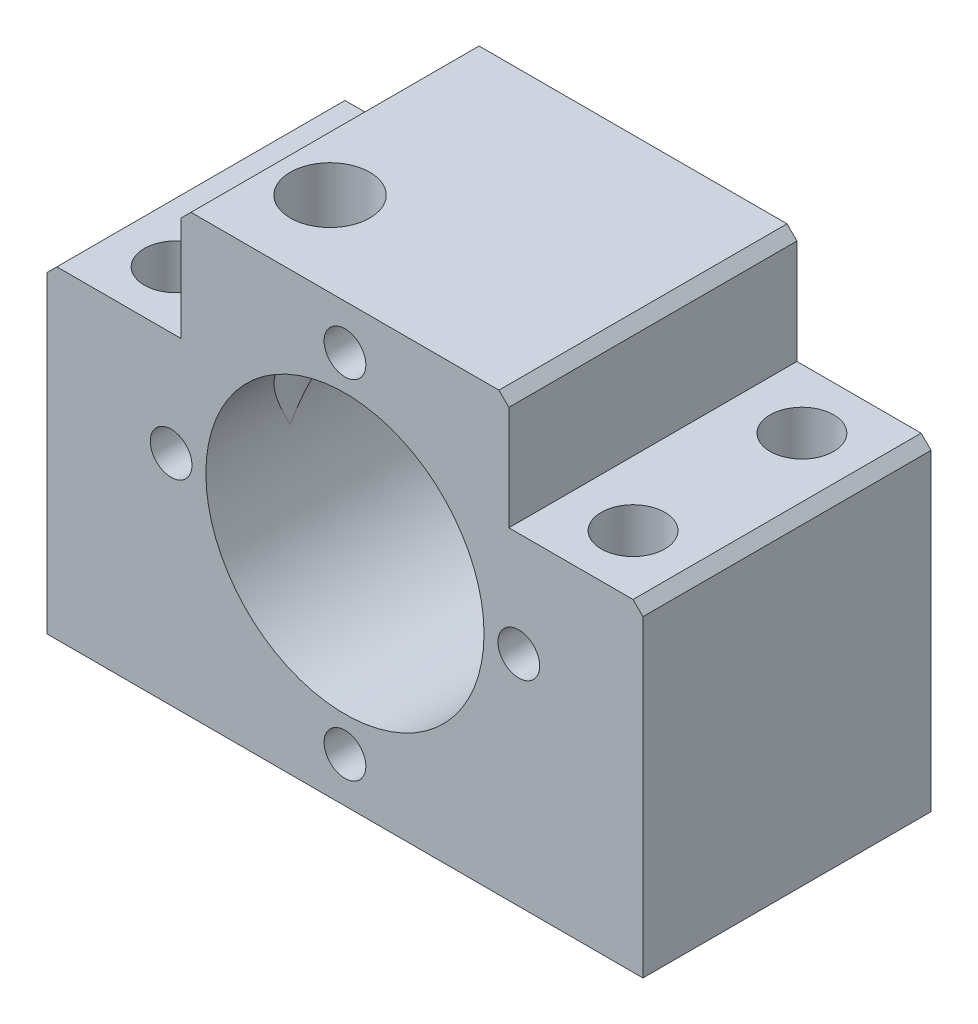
ISO-10303-21;
HEADER;
FILE_DESCRIPTION(('STEP AP214'),'2;1');
FILE_NAME('part.step','',(''),(''),'','','');
FILE_SCHEMA(('AUTOMOTIVE_DESIGN { 1 0 10303 214 1 1 1 1 }'));
ENDSEC;
DATA;
#1=APPLICATION_CONTEXT('core data for automotive mechanical design processes');
#2=APPLICATION_PROTOCOL_DEFINITION('international standard','automotive_design',2000,#1);
#3=PRODUCT_CONTEXT('',#1,'mechanical');
#4=PRODUCT('Part','Part','',(#3));
#5=PRODUCT_RELATED_PRODUCT_CATEGORY('part','',(#4));
#6=PRODUCT_DEFINITION_FORMATION('','',#4);
#7=PRODUCT_DEFINITION_CONTEXT('part definition',#1,'design');
#8=PRODUCT_DEFINITION('design','',#6,#7);
#9=PRODUCT_DEFINITION_SHAPE('','',#8);
#10=(LENGTH_UNIT() NAMED_UNIT(*) SI_UNIT(.MILLI.,.METRE.));
#11=(NAMED_UNIT(*) PLANE_ANGLE_UNIT() SI_UNIT($,.RADIAN.));
#12=(NAMED_UNIT(*) SI_UNIT($,.STERADIAN.) SOLID_ANGLE_UNIT());
#13=UNCERTAINTY_MEASURE_WITH_UNIT(LENGTH_MEASURE(1.E-05),#10,'distance_accuracy_value','');
#14=(GEOMETRIC_REPRESENTATION_CONTEXT(3) GLOBAL_UNCERTAINTY_ASSIGNED_CONTEXT((#13)) GLOBAL_UNIT_ASSIGNED_CONTEXT((#10,
#11,#12)) REPRESENTATION_CONTEXT('',''));
#15=CARTESIAN_POINT('',(0.,0.,0.));
#16=DIRECTION('',(0.,0.,1.));
#17=DIRECTION('',(1.,0.,0.));
#18=AXIS2_PLACEMENT_3D('',#15,#16,#17);
#19=CARTESIAN_POINT('',(0.,0.,29.));
#20=DIRECTION('',(0.,0.,1.));
#21=DIRECTION('',(1.,0.,0.));
#22=AXIS2_PLACEMENT_3D('',#19,#20,#21);
#23=PLANE('',#22);
#24=DIRECTION('',(0.,1.,0.));
#25=VECTOR('',#24,1.);
#26=CARTESIAN_POINT('',(30.,10.5,29.));
#27=LINE('',#26,#25);
#28=CARTESIAN_POINT('',(30.,-22.,29.));
#29=VERTEX_POINT('',#28);
#30=CARTESIAN_POINT('',(30.,9.50000000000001,29.));
#31=VERTEX_POINT('',#30);
#32=EDGE_CURVE('E150',#29,#31,#27,.T.);
#33=ORIENTED_EDGE('',*,*,#32,.T.);
#34=DIRECTION('',(0.707106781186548,-0.707106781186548,0.));
#35=VECTOR('',#34,1.);
#36=CARTESIAN_POINT('',(19.75,19.75,29.));
#37=LINE('',#36,#35);
#38=CARTESIAN_POINT('',(29.,10.5,29.));
#39=VERTEX_POINT('',#38);
#40=EDGE_CURVE('E146',#31,#39,#37,.F.);
#41=ORIENTED_EDGE('',*,*,#40,.T.);
#42=DIRECTION('',(-1.,0.,0.));
#43=VECTOR('',#42,1.);
#44=CARTESIAN_POINT('',(30.,10.5,29.));
#45=LINE('',#44,#43);
#46=CARTESIAN_POINT('',(16.5,10.5,29.));
#47=VERTEX_POINT('',#46);
#48=EDGE_CURVE('E138',#39,#47,#45,.T.);
#49=ORIENTED_EDGE('',*,*,#48,.T.);
#50=DIRECTION('',(0.,1.,0.));
#51=VECTOR('',#50,1.);
#52=CARTESIAN_POINT('',(16.5,10.5,29.));
#53=LINE('',#52,#51);
#54=CARTESIAN_POINT('',(16.5,21.,29.));
#55=VERTEX_POINT('',#54);
#56=EDGE_CURVE('E143',#47,#55,#53,.T.);
#57=ORIENTED_EDGE('',*,*,#56,.T.);
#58=DIRECTION('',(0.70710678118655,-0.707106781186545,0.));
#59=VECTOR('',#58,1.);
#60=CARTESIAN_POINT('',(18.7499999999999,18.7500000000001,29.));
#61=LINE('',#60,#59);
#62=CARTESIAN_POINT('',(15.5,22.,29.));
#63=VERTEX_POINT('',#62);
#64=EDGE_CURVE('E226',#55,#63,#61,.F.);
#65=ORIENTED_EDGE('',*,*,#64,.T.);
#66=DIRECTION('',(-1.,0.,0.));
#67=VECTOR('',#66,1.);
#68=CARTESIAN_POINT('',(-16.5,22.,29.));
#69=LINE('',#68,#67);
#70=CARTESIAN_POINT('',(-15.5,22.,29.));
#71=VERTEX_POINT('',#70);
#72=EDGE_CURVE('E166',#63,#71,#69,.T.);
#73=ORIENTED_EDGE('',*,*,#72,.T.);
#74=DIRECTION('',(0.707106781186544,0.707106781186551,0.));
#75=VECTOR('',#74,1.);
#76=CARTESIAN_POINT('',(-18.7500000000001,18.7499999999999,29.));
#77=LINE('',#76,#75);
#78=CARTESIAN_POINT('',(-16.5,21.,29.));
#79=VERTEX_POINT('',#78);
#80=EDGE_CURVE('E224',#71,#79,#77,.F.);
#81=ORIENTED_EDGE('',*,*,#80,.T.);
#82=DIRECTION('',(0.,-1.,0.));
#83=VECTOR('',#82,1.);
#84=CARTESIAN_POINT('',(-16.5,10.5,29.));
#85=LINE('',#84,#83);
#86=CARTESIAN_POINT('',(-16.5,10.5,29.));
#87=VERTEX_POINT('',#86);
#88=EDGE_CURVE('E169',#79,#87,#85,.T.);
#89=ORIENTED_EDGE('',*,*,#88,.T.);
#90=DIRECTION('',(-1.,0.,0.));
#91=VECTOR('',#90,1.);
#92=CARTESIAN_POINT('',(-30.,10.5,29.));
#93=LINE('',#92,#91);
#94=CARTESIAN_POINT('',(-29.,10.5,29.));
#95=VERTEX_POINT('',#94);
#96=EDGE_CURVE('E174',#87,#95,#93,.T.);
#97=ORIENTED_EDGE('',*,*,#96,.T.);
#98=DIRECTION('',(0.70710678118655,0.707106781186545,0.));
#99=VECTOR('',#98,1.);
#100=CARTESIAN_POINT('',(-19.7499999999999,19.75,29.));
#101=LINE('',#100,#99);
#102=CARTESIAN_POINT('',(-30.,9.49999999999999,29.));
#103=VERTEX_POINT('',#102);
#104=EDGE_CURVE('E67',#95,#103,#101,.F.);
#105=ORIENTED_EDGE('',*,*,#104,.T.);
#106=DIRECTION('',(0.,-1.,0.));
#107=VECTOR('',#106,1.);
#108=CARTESIAN_POINT('',(-30.,10.5,29.));
#109=LINE('',#108,#107);
#110=CARTESIAN_POINT('',(-30.,-22.,29.));
#111=VERTEX_POINT('',#110);
#112=EDGE_CURVE('E176',#103,#111,#109,.T.);
#113=ORIENTED_EDGE('',*,*,#112,.T.);
#114=DIRECTION('',(1.,0.,0.));
#115=VECTOR('',#114,1.);
#116=CARTESIAN_POINT('',(-30.,-22.,29.));
#117=LINE('',#116,#115);
#118=EDGE_CURVE('E178',#111,#29,#117,.T.);
#119=ORIENTED_EDGE('',*,*,#118,.T.);
#120=EDGE_LOOP('',(#33,#41,#49,#57,#65,#73,#81,#89,#97,#105,#113,#119));
#121=FACE_BOUND('',#120,.T.);
#122=CARTESIAN_POINT('',(0.,0.,29.));
#123=DIRECTION('',(0.,0.,-1.));
#124=DIRECTION('',(-1.,0.,0.));
#125=AXIS2_PLACEMENT_3D('',#122,#123,#124);
#126=CIRCLE('',#125,14.);
#127=CARTESIAN_POINT('',(-14.,0.,29.));
#128=VERTEX_POINT('',#127);
#129=EDGE_CURVE('E211',#128,#128,#126,.T.);
#130=ORIENTED_EDGE('',*,*,#129,.T.);
#131=EDGE_LOOP('',(#130));
#132=FACE_BOUND('',#131,.T.);
#133=CARTESIAN_POINT('',(0.,17.5,29.));
#134=DIRECTION('',(0.,0.,-1.));
#135=DIRECTION('',(-1.,0.,0.));
#136=AXIS2_PLACEMENT_3D('',#133,#134,#135);
#137=CIRCLE('',#136,2.09999999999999);
#138=CARTESIAN_POINT('',(-2.09999999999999,17.5,29.));
#139=VERTEX_POINT('',#138);
#140=EDGE_CURVE('E380',#139,#139,#137,.T.);
#141=ORIENTED_EDGE('',*,*,#140,.T.);
#142=EDGE_LOOP('',(#141));
#143=FACE_BOUND('',#142,.T.);
#144=CARTESIAN_POINT('',(0.,-17.5,29.));
#145=DIRECTION('',(0.,0.,-1.));
#146=DIRECTION('',(-1.,0.,0.));
#147=AXIS2_PLACEMENT_3D('',#144,#145,#146);
#148=CIRCLE('',#147,2.09999999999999);
#149=CARTESIAN_POINT('',(-2.09999999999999,-17.5,29.));
#150=VERTEX_POINT('',#149);
#151=EDGE_CURVE('E388',#150,#150,#148,.T.);
#152=ORIENTED_EDGE('',*,*,#151,.T.);
#153=EDGE_LOOP('',(#152));
#154=FACE_BOUND('',#153,.T.);
#155=CARTESIAN_POINT('',(17.5,0.,29.));
#156=DIRECTION('',(0.,0.,-1.));
#157=DIRECTION('',(-1.,0.,0.));
#158=AXIS2_PLACEMENT_3D('',#155,#156,#157);
#159=CIRCLE('',#158,2.09999999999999);
#160=CARTESIAN_POINT('',(15.4,0.,29.));
#161=VERTEX_POINT('',#160);
#162=EDGE_CURVE('E394',#161,#161,#159,.T.);
#163=ORIENTED_EDGE('',*,*,#162,.T.);
#164=EDGE_LOOP('',(#163));
#165=FACE_BOUND('',#164,.T.);
#166=CARTESIAN_POINT('',(-17.5,0.,29.));
#167=DIRECTION('',(0.,0.,-1.));
#168=DIRECTION('',(-1.,0.,0.));
#169=AXIS2_PLACEMENT_3D('',#166,#167,#168);
#170=CIRCLE('',#169,2.09999999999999);
#171=CARTESIAN_POINT('',(-19.6,0.,29.));
#172=VERTEX_POINT('',#171);
#173=EDGE_CURVE('E400',#172,#172,#170,.T.);
#174=ORIENTED_EDGE('',*,*,#173,.T.);
#175=EDGE_LOOP('',(#174));
#176=FACE_BOUND('',#175,.T.);
#177=ADVANCED_FACE('F47',(#121,#132,#143,#154,#165,#176),#23,.T.);
#178=CARTESIAN_POINT('',(0.,0.,0.));
#179=DIRECTION('',(0.,0.,1.));
#180=DIRECTION('',(1.,0.,0.));
#181=AXIS2_PLACEMENT_3D('',#178,#179,#180);
#182=PLANE('',#181);
#183=CARTESIAN_POINT('',(0.,0.,0.));
#184=DIRECTION('',(0.,0.,1.));
#185=DIRECTION('',(1.,0.,0.));
#186=AXIS2_PLACEMENT_3D('',#183,#184,#185);
#187=CIRCLE('',#186,13.5);
#188=CARTESIAN_POINT('',(13.5,0.,0.));
#189=VERTEX_POINT('',#188);
#190=EDGE_CURVE('E55',#189,#189,#187,.T.);
#191=ORIENTED_EDGE('',*,*,#190,.T.);
#192=EDGE_LOOP('',(#191));
#193=FACE_BOUND('',#192,.T.);
#194=CARTESIAN_POINT('',(-17.5,0.,0.));
#195=DIRECTION('',(0.,0.,-1.));
#196=DIRECTION('',(-1.,0.,0.));
#197=AXIS2_PLACEMENT_3D('',#194,#195,#196);
#198=CIRCLE('',#197,2.1);
#199=CARTESIAN_POINT('',(-19.6,0.,0.));
#200=VERTEX_POINT('',#199);
#201=EDGE_CURVE('E248',#200,#200,#198,.T.);
#202=ORIENTED_EDGE('',*,*,#201,.F.);
#203=EDGE_LOOP('',(#202));
#204=FACE_BOUND('',#203,.T.);
#205=CARTESIAN_POINT('',(0.,-17.5,0.));
#206=DIRECTION('',(0.,0.,-1.));
#207=DIRECTION('',(-1.,0.,0.));
#208=AXIS2_PLACEMENT_3D('',#205,#206,#207);
#209=CIRCLE('',#208,2.1);
#210=CARTESIAN_POINT('',(-2.1,-17.5,0.));
#211=VERTEX_POINT('',#210);
#212=EDGE_CURVE('E391',#211,#211,#209,.T.);
#213=ORIENTED_EDGE('',*,*,#212,.F.);
#214=EDGE_LOOP('',(#213));
#215=FACE_BOUND('',#214,.T.);
#216=CARTESIAN_POINT('',(0.,17.5,0.));
#217=DIRECTION('',(0.,0.,-1.));
#218=DIRECTION('',(-1.,0.,0.));
#219=AXIS2_PLACEMENT_3D('',#216,#217,#218);
#220=CIRCLE('',#219,2.1);
#221=CARTESIAN_POINT('',(-2.1,17.5,0.));
#222=VERTEX_POINT('',#221);
#223=EDGE_CURVE('E385',#222,#222,#220,.T.);
#224=ORIENTED_EDGE('',*,*,#223,.F.);
#225=EDGE_LOOP('',(#224));
#226=FACE_BOUND('',#225,.T.);
#227=DIRECTION('',(-1.,0.,0.));
#228=VECTOR('',#227,1.);
#229=CARTESIAN_POINT('',(30.,10.5,0.));
#230=LINE('',#229,#228);
#231=CARTESIAN_POINT('',(29.,10.5,0.));
#232=VERTEX_POINT('',#231);
#233=CARTESIAN_POINT('',(16.5,10.5,0.));
#234=VERTEX_POINT('',#233);
#235=EDGE_CURVE('E156',#232,#234,#230,.T.);
#236=ORIENTED_EDGE('',*,*,#235,.F.);
#237=DIRECTION('',(-0.707106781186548,0.707106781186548,0.));
#238=VECTOR('',#237,1.);
#239=CARTESIAN_POINT('',(29.,10.5,0.));
#240=LINE('',#239,#238);
#241=CARTESIAN_POINT('',(30.,9.50000000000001,0.));
#242=VERTEX_POINT('',#241);
#243=EDGE_CURVE('E219',#232,#242,#240,.F.);
#244=ORIENTED_EDGE('',*,*,#243,.T.);
#245=DIRECTION('',(0.,1.,0.));
#246=VECTOR('',#245,1.);
#247=CARTESIAN_POINT('',(30.,10.5,0.));
#248=LINE('',#247,#246);
#249=CARTESIAN_POINT('',(30.,-22.,0.));
#250=VERTEX_POINT('',#249);
#251=EDGE_CURVE('E181',#250,#242,#248,.T.);
#252=ORIENTED_EDGE('',*,*,#251,.F.);
#253=DIRECTION('',(1.,0.,0.));
#254=VECTOR('',#253,1.);
#255=CARTESIAN_POINT('',(-30.,-22.,0.));
#256=LINE('',#255,#254);
#257=CARTESIAN_POINT('',(-30.,-22.,0.));
#258=VERTEX_POINT('',#257);
#259=EDGE_CURVE('E198',#258,#250,#256,.T.);
#260=ORIENTED_EDGE('',*,*,#259,.F.);
#261=DIRECTION('',(0.,-1.,0.));
#262=VECTOR('',#261,1.);
#263=CARTESIAN_POINT('',(-30.,10.5,0.));
#264=LINE('',#263,#262);
#265=CARTESIAN_POINT('',(-30.,9.49999999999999,0.));
#266=VERTEX_POINT('',#265);
#267=EDGE_CURVE('E196',#266,#258,#264,.T.);
#268=ORIENTED_EDGE('',*,*,#267,.F.);
#269=DIRECTION('',(-0.70710678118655,-0.707106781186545,0.));
#270=VECTOR('',#269,1.);
#271=CARTESIAN_POINT('',(-30.,9.49999999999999,0.));
#272=LINE('',#271,#270);
#273=CARTESIAN_POINT('',(-29.,10.5,0.));
#274=VERTEX_POINT('',#273);
#275=EDGE_CURVE('E213',#266,#274,#272,.F.);
#276=ORIENTED_EDGE('',*,*,#275,.T.);
#277=DIRECTION('',(-1.,0.,0.));
#278=VECTOR('',#277,1.);
#279=CARTESIAN_POINT('',(-30.,10.5,0.));
#280=LINE('',#279,#278);
#281=CARTESIAN_POINT('',(-16.5,10.5,0.));
#282=VERTEX_POINT('',#281);
#283=EDGE_CURVE('E193',#282,#274,#280,.T.);
#284=ORIENTED_EDGE('',*,*,#283,.F.);
#285=DIRECTION('',(0.,-1.,0.));
#286=VECTOR('',#285,1.);
#287=CARTESIAN_POINT('',(-16.5,10.5,0.));
#288=LINE('',#287,#286);
#289=CARTESIAN_POINT('',(-16.5,21.,0.));
#290=VERTEX_POINT('',#289);
#291=EDGE_CURVE('E191',#290,#282,#288,.T.);
#292=ORIENTED_EDGE('',*,*,#291,.F.);
#293=DIRECTION('',(-0.707106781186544,-0.707106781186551,0.));
#294=VECTOR('',#293,1.);
#295=CARTESIAN_POINT('',(-16.5,21.,0.));
#296=LINE('',#295,#294);
#297=CARTESIAN_POINT('',(-15.5,22.,0.));
#298=VERTEX_POINT('',#297);
#299=EDGE_CURVE('E215',#290,#298,#296,.F.);
#300=ORIENTED_EDGE('',*,*,#299,.T.);
#301=DIRECTION('',(-1.,0.,0.));
#302=VECTOR('',#301,1.);
#303=CARTESIAN_POINT('',(-16.5,22.,0.));
#304=LINE('',#303,#302);
#305=CARTESIAN_POINT('',(15.5,22.,0.));
#306=VERTEX_POINT('',#305);
#307=EDGE_CURVE('E188',#306,#298,#304,.T.);
#308=ORIENTED_EDGE('',*,*,#307,.F.);
#309=DIRECTION('',(-0.70710678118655,0.707106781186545,0.));
#310=VECTOR('',#309,1.);
#311=CARTESIAN_POINT('',(15.5,22.,0.));
#312=LINE('',#311,#310);
#313=CARTESIAN_POINT('',(16.5,21.,0.));
#314=VERTEX_POINT('',#313);
#315=EDGE_CURVE('E217',#306,#314,#312,.F.);
#316=ORIENTED_EDGE('',*,*,#315,.T.);
#317=DIRECTION('',(0.,1.,0.));
#318=VECTOR('',#317,1.);
#319=CARTESIAN_POINT('',(16.5,10.5,0.));
#320=LINE('',#319,#318);
#321=EDGE_CURVE('E186',#234,#314,#320,.T.);
#322=ORIENTED_EDGE('',*,*,#321,.F.);
#323=EDGE_LOOP('',(#236,#244,#252,#260,#268,#276,#284,#292,#300,#308,#316,#322));
#324=FACE_BOUND('',#323,.T.);
#325=CARTESIAN_POINT('',(17.5,0.,0.));
#326=DIRECTION('',(0.,0.,-1.));
#327=DIRECTION('',(-1.,0.,0.));
#328=AXIS2_PLACEMENT_3D('',#325,#326,#327);
#329=CIRCLE('',#328,2.09999999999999);
#330=CARTESIAN_POINT('',(15.4,0.,0.));
#331=VERTEX_POINT('',#330);
#332=EDGE_CURVE('E397',#331,#331,#329,.T.);
#333=ORIENTED_EDGE('',*,*,#332,.F.);
#334=EDGE_LOOP('',(#333));
#335=FACE_BOUND('',#334,.T.);
#336=ADVANCED_FACE('F290',(#193,#204,#215,#226,#324,#335),#182,.F.);
#337=CARTESIAN_POINT('',(30.,10.5,29.));
#338=DIRECTION('',(-1.,0.,0.));
#339=DIRECTION('',(0.,-1.,0.));
#340=AXIS2_PLACEMENT_3D('',#337,#338,#339);
#341=PLANE('',#340);
#342=ORIENTED_EDGE('',*,*,#251,.T.);
#343=DIRECTION('',(0.,0.,1.));
#344=VECTOR('',#343,1.);
#345=CARTESIAN_POINT('',(30.,9.50000000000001,29.));
#346=LINE('',#345,#344);
#347=EDGE_CURVE('E221',#242,#31,#346,.T.);
#348=ORIENTED_EDGE('',*,*,#347,.T.);
#349=ORIENTED_EDGE('',*,*,#32,.F.);
#350=DIRECTION('',(0.,0.,-1.));
#351=VECTOR('',#350,1.);
#352=CARTESIAN_POINT('',(30.,-22.,29.));
#353=LINE('',#352,#351);
#354=EDGE_CURVE('E180',#29,#250,#353,.T.);
#355=ORIENTED_EDGE('',*,*,#354,.T.);
#356=EDGE_LOOP('',(#342,#348,#349,#355));
#357=FACE_BOUND('',#356,.T.);
#358=ADVANCED_FACE('F295',(#357),#341,.F.);
#359=CARTESIAN_POINT('',(30.,10.5,29.));
#360=DIRECTION('',(0.,-1.,0.));
#361=DIRECTION('',(1.,0.,0.));
#362=AXIS2_PLACEMENT_3D('',#359,#360,#361);
#363=PLANE('',#362);
#364=CARTESIAN_POINT('',(23.,10.5,23.));
#365=DIRECTION('',(0.,-1.,0.));
#366=DIRECTION('',(1.,0.,0.));
#367=AXIS2_PLACEMENT_3D('',#364,#365,#366);
#368=CIRCLE('',#367,3.2);
#369=CARTESIAN_POINT('',(26.2,10.5,23.));
#370=VERTEX_POINT('',#369);
#371=EDGE_CURVE('E360',#370,#370,#368,.T.);
#372=ORIENTED_EDGE('',*,*,#371,.T.);
#373=EDGE_LOOP('',(#372));
#374=FACE_BOUND('',#373,.T.);
#375=CARTESIAN_POINT('',(23.,10.5,5.99999999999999));
#376=DIRECTION('',(0.,-1.,0.));
#377=DIRECTION('',(1.,0.,0.));
#378=AXIS2_PLACEMENT_3D('',#375,#376,#377);
#379=CIRCLE('',#378,3.2);
#380=CARTESIAN_POINT('',(26.2,10.5,5.99999999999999));
#381=VERTEX_POINT('',#380);
#382=EDGE_CURVE('E184',#381,#381,#379,.T.);
#383=ORIENTED_EDGE('',*,*,#382,.T.);
#384=EDGE_LOOP('',(#383));
#385=FACE_BOUND('',#384,.T.);
#386=ORIENTED_EDGE('',*,*,#48,.F.);
#387=DIRECTION('',(0.,0.,-1.));
#388=VECTOR('',#387,1.);
#389=CARTESIAN_POINT('',(29.,10.5,29.));
#390=LINE('',#389,#388);
#391=EDGE_CURVE('E160',#39,#232,#390,.T.);
#392=ORIENTED_EDGE('',*,*,#391,.T.);
#393=ORIENTED_EDGE('',*,*,#235,.T.);
#394=DIRECTION('',(0.,0.,-1.));
#395=VECTOR('',#394,1.);
#396=CARTESIAN_POINT('',(16.5,10.5,29.));
#397=LINE('',#396,#395);
#398=EDGE_CURVE('E153',#47,#234,#397,.T.);
#399=ORIENTED_EDGE('',*,*,#398,.F.);
#400=EDGE_LOOP('',(#386,#392,#393,#399));
#401=FACE_BOUND('',#400,.T.);
#402=ADVANCED_FACE('F154',(#374,#385,#401),#363,.F.);
#403=CARTESIAN_POINT('',(16.5,10.5,29.));
#404=DIRECTION('',(-1.,0.,0.));
#405=DIRECTION('',(0.,-1.,0.));
#406=AXIS2_PLACEMENT_3D('',#403,#404,#405);
#407=PLANE('',#406);
#408=ORIENTED_EDGE('',*,*,#321,.T.);
#409=DIRECTION('',(0.,0.,1.));
#410=VECTOR('',#409,1.);
#411=CARTESIAN_POINT('',(16.5,21.,29.));
#412=LINE('',#411,#410);
#413=EDGE_CURVE('E165',#314,#55,#412,.T.);
#414=ORIENTED_EDGE('',*,*,#413,.T.);
#415=ORIENTED_EDGE('',*,*,#56,.F.);
#416=ORIENTED_EDGE('',*,*,#398,.T.);
#417=EDGE_LOOP('',(#408,#414,#415,#416));
#418=FACE_BOUND('',#417,.T.);
#419=ADVANCED_FACE('F163',(#418),#407,.F.);
#420=CARTESIAN_POINT('',(-16.5,22.,29.));
#421=DIRECTION('',(0.,-1.,0.));
#422=DIRECTION('',(1.,0.,0.));
#423=AXIS2_PLACEMENT_3D('',#420,#421,#422);
#424=PLANE('',#423);
#425=CARTESIAN_POINT('',(-10.,22.,20.5));
#426=DIRECTION('',(0.,1.,0.));
#427=DIRECTION('',(0.,0.,1.));
#428=AXIS2_PLACEMENT_3D('',#425,#426,#427);
#429=CIRCLE('',#428,3.99999999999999);
#430=CARTESIAN_POINT('',(-10.,22.,24.5));
#431=VERTEX_POINT('',#430);
#432=EDGE_CURVE('E249',#431,#431,#429,.T.);
#433=ORIENTED_EDGE('',*,*,#432,.F.);
#434=EDGE_LOOP('',(#433));
#435=FACE_BOUND('',#434,.T.);
#436=ORIENTED_EDGE('',*,*,#72,.F.);
#437=DIRECTION('',(0.,0.,-1.));
#438=VECTOR('',#437,1.);
#439=CARTESIAN_POINT('',(15.5,22.,29.));
#440=LINE('',#439,#438);
#441=EDGE_CURVE('E231',#63,#306,#440,.T.);
#442=ORIENTED_EDGE('',*,*,#441,.T.);
#443=ORIENTED_EDGE('',*,*,#307,.T.);
#444=DIRECTION('',(0.,0.,1.));
#445=VECTOR('',#444,1.);
#446=CARTESIAN_POINT('',(-15.5,22.,29.));
#447=LINE('',#446,#445);
#448=EDGE_CURVE('E229',#298,#71,#447,.T.);
#449=ORIENTED_EDGE('',*,*,#448,.T.);
#450=EDGE_LOOP('',(#436,#442,#443,#449));
#451=FACE_BOUND('',#450,.T.);
#452=ADVANCED_FACE('F317',(#435,#451),#424,.F.);
#453=CARTESIAN_POINT('',(-16.5,10.5,29.));
#454=DIRECTION('',(1.,0.,0.));
#455=DIRECTION('',(0.,1.,0.));
#456=AXIS2_PLACEMENT_3D('',#453,#454,#455);
#457=PLANE('',#456);
#458=ORIENTED_EDGE('',*,*,#88,.F.);
#459=DIRECTION('',(0.,0.,-1.));
#460=VECTOR('',#459,1.);
#461=CARTESIAN_POINT('',(-16.5,21.,29.));
#462=LINE('',#461,#460);
#463=EDGE_CURVE('E235',#79,#290,#462,.T.);
#464=ORIENTED_EDGE('',*,*,#463,.T.);
#465=ORIENTED_EDGE('',*,*,#291,.T.);
#466=DIRECTION('',(0.,0.,-1.));
#467=VECTOR('',#466,1.);
#468=CARTESIAN_POINT('',(-16.5,10.5,29.));
#469=LINE('',#468,#467);
#470=EDGE_CURVE('E161',#87,#282,#469,.T.);
#471=ORIENTED_EDGE('',*,*,#470,.F.);
#472=EDGE_LOOP('',(#458,#464,#465,#471));
#473=FACE_BOUND('',#472,.T.);
#474=ADVANCED_FACE('F313',(#473),#457,.F.);
#475=CARTESIAN_POINT('',(-30.,10.5,29.));
#476=DIRECTION('',(0.,-1.,0.));
#477=DIRECTION('',(1.,0.,0.));
#478=AXIS2_PLACEMENT_3D('',#475,#476,#477);
#479=PLANE('',#478);
#480=CARTESIAN_POINT('',(-23.,10.5,6.));
#481=DIRECTION('',(0.,-1.,0.));
#482=DIRECTION('',(1.,0.,0.));
#483=AXIS2_PLACEMENT_3D('',#480,#481,#482);
#484=CIRCLE('',#483,3.2);
#485=CARTESIAN_POINT('',(-19.8,10.5,6.));
#486=VERTEX_POINT('',#485);
#487=EDGE_CURVE('E372',#486,#486,#484,.T.);
#488=ORIENTED_EDGE('',*,*,#487,.T.);
#489=EDGE_LOOP('',(#488));
#490=FACE_BOUND('',#489,.T.);
#491=CARTESIAN_POINT('',(-23.,10.5,23.));
#492=DIRECTION('',(0.,-1.,0.));
#493=DIRECTION('',(1.,0.,0.));
#494=AXIS2_PLACEMENT_3D('',#491,#492,#493);
#495=CIRCLE('',#494,3.2);
#496=CARTESIAN_POINT('',(-19.8,10.5,23.));
#497=VERTEX_POINT('',#496);
#498=EDGE_CURVE('E366',#497,#497,#495,.T.);
#499=ORIENTED_EDGE('',*,*,#498,.T.);
#500=EDGE_LOOP('',(#499));
#501=FACE_BOUND('',#500,.T.);
#502=ORIENTED_EDGE('',*,*,#283,.T.);
#503=DIRECTION('',(0.,0.,1.));
#504=VECTOR('',#503,1.);
#505=CARTESIAN_POINT('',(-29.,10.5,29.));
#506=LINE('',#505,#504);
#507=EDGE_CURVE('E241',#274,#95,#506,.T.);
#508=ORIENTED_EDGE('',*,*,#507,.T.);
#509=ORIENTED_EDGE('',*,*,#96,.F.);
#510=ORIENTED_EDGE('',*,*,#470,.T.);
#511=EDGE_LOOP('',(#502,#508,#509,#510));
#512=FACE_BOUND('',#511,.T.);
#513=ADVANCED_FACE('F309',(#490,#501,#512),#479,.F.);
#514=CARTESIAN_POINT('',(-30.,10.5,29.));
#515=DIRECTION('',(1.,0.,0.));
#516=DIRECTION('',(0.,0.,-1.));
#517=AXIS2_PLACEMENT_3D('',#514,#515,#516);
#518=PLANE('',#517);
#519=ORIENTED_EDGE('',*,*,#112,.F.);
#520=DIRECTION('',(0.,0.,-1.));
#521=VECTOR('',#520,1.);
#522=CARTESIAN_POINT('',(-30.,9.49999999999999,29.));
#523=LINE('',#522,#521);
#524=EDGE_CURVE('E238',#103,#266,#523,.T.);
#525=ORIENTED_EDGE('',*,*,#524,.T.);
#526=ORIENTED_EDGE('',*,*,#267,.T.);
#527=DIRECTION('',(0.,0.,-1.));
#528=VECTOR('',#527,1.);
#529=CARTESIAN_POINT('',(-30.,-22.,29.));
#530=LINE('',#529,#528);
#531=EDGE_CURVE('E202',#111,#258,#530,.T.);
#532=ORIENTED_EDGE('',*,*,#531,.F.);
#533=EDGE_LOOP('',(#519,#525,#526,#532));
#534=FACE_BOUND('',#533,.T.);
#535=ADVANCED_FACE('F305',(#534),#518,.F.);
#536=CARTESIAN_POINT('',(-30.,-22.,29.));
#537=DIRECTION('',(0.,1.,0.));
#538=DIRECTION('',(-1.,0.,0.));
#539=AXIS2_PLACEMENT_3D('',#536,#537,#538);
#540=PLANE('',#539);
#541=CARTESIAN_POINT('',(-23.,-22.,6.));
#542=DIRECTION('',(0.,1.,0.));
#543=DIRECTION('',(0.,0.,1.));
#544=AXIS2_PLACEMENT_3D('',#541,#542,#543);
#545=CIRCLE('',#544,3.19999999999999);
#546=CARTESIAN_POINT('',(-23.,-22.,9.19999999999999));
#547=VERTEX_POINT('',#546);
#548=EDGE_CURVE('E210',#547,#547,#545,.T.);
#549=ORIENTED_EDGE('',*,*,#548,.T.);
#550=EDGE_LOOP('',(#549));
#551=FACE_BOUND('',#550,.T.);
#552=CARTESIAN_POINT('',(-23.,-22.,23.));
#553=DIRECTION('',(0.,1.,0.));
#554=DIRECTION('',(0.,0.,1.));
#555=AXIS2_PLACEMENT_3D('',#552,#553,#554);
#556=CIRCLE('',#555,3.19999999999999);
#557=CARTESIAN_POINT('',(-23.,-22.,26.2));
#558=VERTEX_POINT('',#557);
#559=EDGE_CURVE('E369',#558,#558,#556,.T.);
#560=ORIENTED_EDGE('',*,*,#559,.T.);
#561=EDGE_LOOP('',(#560));
#562=FACE_BOUND('',#561,.T.);
#563=CARTESIAN_POINT('',(23.,-22.,23.));
#564=DIRECTION('',(0.,1.,0.));
#565=DIRECTION('',(0.,0.,1.));
#566=AXIS2_PLACEMENT_3D('',#563,#564,#565);
#567=CIRCLE('',#566,3.19999999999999);
#568=CARTESIAN_POINT('',(23.,-22.,26.2));
#569=VERTEX_POINT('',#568);
#570=EDGE_CURVE('E363',#569,#569,#567,.T.);
#571=ORIENTED_EDGE('',*,*,#570,.T.);
#572=EDGE_LOOP('',(#571));
#573=FACE_BOUND('',#572,.T.);
#574=CARTESIAN_POINT('',(23.,-22.,5.99999999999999));
#575=DIRECTION('',(0.,1.,0.));
#576=DIRECTION('',(0.,0.,1.));
#577=AXIS2_PLACEMENT_3D('',#574,#575,#576);
#578=CIRCLE('',#577,3.19999999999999);
#579=CARTESIAN_POINT('',(23.,-22.,9.19999999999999));
#580=VERTEX_POINT('',#579);
#581=EDGE_CURVE('E357',#580,#580,#578,.T.);
#582=ORIENTED_EDGE('',*,*,#581,.T.);
#583=EDGE_LOOP('',(#582));
#584=FACE_BOUND('',#583,.T.);
#585=ORIENTED_EDGE('',*,*,#259,.T.);
#586=ORIENTED_EDGE('',*,*,#354,.F.);
#587=ORIENTED_EDGE('',*,*,#118,.F.);
#588=ORIENTED_EDGE('',*,*,#531,.T.);
#589=EDGE_LOOP('',(#585,#586,#587,#588));
#590=FACE_BOUND('',#589,.T.);
#591=ADVANCED_FACE('F302',(#551,#562,#573,#584,#590),#540,.F.);
#592=CARTESIAN_POINT('',(0.,0.,29.));
#593=DIRECTION('',(0.,0.,-1.));
#594=DIRECTION('',(-1.,0.,0.));
#595=AXIS2_PLACEMENT_3D('',#592,#593,#594);
#596=CYLINDRICAL_SURFACE('',#595,12.5);
#597=CARTESIAN_POINT('',(0.,0.,0.99999999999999));
#598=DIRECTION('',(0.,0.,1.));
#599=DIRECTION('',(1.,0.,0.));
#600=AXIS2_PLACEMENT_3D('',#597,#598,#599);
#601=CIRCLE('',#600,12.5);
#602=CARTESIAN_POINT('',(-12.5,0.,0.999999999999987));
#603=VERTEX_POINT('',#602);
#604=EDGE_CURVE('E13',#603,#603,#601,.F.);
#605=CARTESIAN_POINT('',(0.,0.,3.));
#606=DIRECTION('',(0.,0.,-1.));
#607=DIRECTION('',(-1.,0.,0.));
#608=AXIS2_PLACEMENT_3D('',#605,#606,#607);
#609=CIRCLE('',#608,12.5);
#610=CARTESIAN_POINT('',(-12.5,0.,3.));
#611=VERTEX_POINT('',#610);
#612=EDGE_CURVE('E207',#611,#611,#609,.T.);
#613=CARTESIAN_POINT('',(-12.5,0.,0.999999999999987));
#614=CARTESIAN_POINT('',(-12.5,0.,1.02083333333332));
#615=CARTESIAN_POINT('',(-12.5,0.,1.04166666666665));
#616=CARTESIAN_POINT('',(-12.5,0.,1.08333333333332));
#617=CARTESIAN_POINT('',(-12.5,0.,1.10416666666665));
#618=CARTESIAN_POINT('',(-12.5,0.,1.14583333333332));
#619=CARTESIAN_POINT('',(-12.5,0.,1.16666666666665));
#620=CARTESIAN_POINT('',(-12.5,0.,1.20833333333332));
#621=CARTESIAN_POINT('',(-12.5,0.,1.22916666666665));
#622=CARTESIAN_POINT('',(-12.5,0.,1.27083333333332));
#623=CARTESIAN_POINT('',(-12.5,0.,1.29166666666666));
#624=CARTESIAN_POINT('',(-12.5,0.,1.33333333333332));
#625=CARTESIAN_POINT('',(-12.5,0.,1.35416666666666));
#626=CARTESIAN_POINT('',(-12.5,0.,1.39583333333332));
#627=CARTESIAN_POINT('',(-12.5,0.,1.41666666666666));
#628=CARTESIAN_POINT('',(-12.5,0.,1.45833333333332));
#629=CARTESIAN_POINT('',(-12.5,0.,1.47916666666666));
#630=CARTESIAN_POINT('',(-12.5,0.,1.52083333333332));
#631=CARTESIAN_POINT('',(-12.5,0.,1.54166666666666));
#632=CARTESIAN_POINT('',(-12.5,0.,1.58333333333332));
#633=CARTESIAN_POINT('',(-12.5,0.,1.60416666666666));
#634=CARTESIAN_POINT('',(-12.5,0.,1.64583333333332));
#635=CARTESIAN_POINT('',(-12.5,0.,1.66666666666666));
#636=CARTESIAN_POINT('',(-12.5,0.,1.70833333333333));
#637=CARTESIAN_POINT('',(-12.5,0.,1.72916666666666));
#638=CARTESIAN_POINT('',(-12.5,0.,1.77083333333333));
#639=CARTESIAN_POINT('',(-12.5,0.,1.79166666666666));
#640=CARTESIAN_POINT('',(-12.5,0.,1.83333333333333));
#641=CARTESIAN_POINT('',(-12.5,0.,1.85416666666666));
#642=CARTESIAN_POINT('',(-12.5,0.,1.89583333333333));
#643=CARTESIAN_POINT('',(-12.5,0.,1.91666666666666));
#644=CARTESIAN_POINT('',(-12.5,0.,1.95833333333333));
#645=CARTESIAN_POINT('',(-12.5,0.,1.97916666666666));
#646=CARTESIAN_POINT('',(-12.5,0.,2.02083333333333));
#647=CARTESIAN_POINT('',(-12.5,0.,2.04166666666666));
#648=CARTESIAN_POINT('',(-12.5,0.,2.08333333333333));
#649=CARTESIAN_POINT('',(-12.5,0.,2.10416666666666));
#650=CARTESIAN_POINT('',(-12.5,0.,2.14583333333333));
#651=CARTESIAN_POINT('',(-12.5,0.,2.16666666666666));
#652=CARTESIAN_POINT('',(-12.5,0.,2.20833333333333));
#653=CARTESIAN_POINT('',(-12.5,0.,2.22916666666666));
#654=CARTESIAN_POINT('',(-12.5,0.,2.27083333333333));
#655=CARTESIAN_POINT('',(-12.5,0.,2.29166666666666));
#656=CARTESIAN_POINT('',(-12.5,0.,2.33333333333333));
#657=CARTESIAN_POINT('',(-12.5,0.,2.35416666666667));
#658=CARTESIAN_POINT('',(-12.5,0.,2.39583333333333));
#659=CARTESIAN_POINT('',(-12.5,0.,2.41666666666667));
#660=CARTESIAN_POINT('',(-12.5,0.,2.45833333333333));
#661=CARTESIAN_POINT('',(-12.5,0.,2.47916666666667));
#662=CARTESIAN_POINT('',(-12.5,0.,2.52083333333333));
#663=CARTESIAN_POINT('',(-12.5,0.,2.54166666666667));
#664=CARTESIAN_POINT('',(-12.5,0.,2.58333333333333));
#665=CARTESIAN_POINT('',(-12.5,0.,2.60416666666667));
#666=CARTESIAN_POINT('',(-12.5,0.,2.64583333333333));
#667=CARTESIAN_POINT('',(-12.5,0.,2.66666666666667));
#668=CARTESIAN_POINT('',(-12.5,0.,2.70833333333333));
#669=CARTESIAN_POINT('',(-12.5,0.,2.72916666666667));
#670=CARTESIAN_POINT('',(-12.5,0.,2.77083333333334));
#671=CARTESIAN_POINT('',(-12.5,0.,2.79166666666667));
#672=CARTESIAN_POINT('',(-12.5,0.,2.83333333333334));
#673=CARTESIAN_POINT('',(-12.5,0.,2.85416666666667));
#674=CARTESIAN_POINT('',(-12.5,0.,2.89583333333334));
#675=CARTESIAN_POINT('',(-12.5,0.,2.91666666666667));
#676=CARTESIAN_POINT('',(-12.5,0.,2.95833333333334));
#677=CARTESIAN_POINT('',(-12.5,0.,2.97916666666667));
#678=CARTESIAN_POINT('',(-12.5,0.,3.));
#679=B_SPLINE_CURVE_WITH_KNOTS('',3,(#613,#614,#615,#616,#617,#618,#619,#620,#621,#622,#623,
#624,#625,#626,#627,#628,#629,#630,#631,#632,#633,#634,#635,#636,#637,#638,#639,#640,#641,#642,
#643,#644,#645,#646,#647,#648,#649,#650,#651,#652,#653,#654,#655,#656,#657,#658,#659,#660,#661,
#662,#663,#664,#665,#666,#667,#668,#669,#670,#671,#672,#673,#674,#675,#676,#677,#678),
.UNSPECIFIED.,.F.,.F.,(4,2,2,2,2,2,2,2,2,2,2,2,2,2,2,2,2,2,2,2,2,2,2,2,2,2,2,2,2,2,2,2,4),(0.,
0.0625000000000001,0.125,0.1875,0.25,0.312500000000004,0.375000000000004,0.437500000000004,
0.500000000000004,0.562500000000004,0.625000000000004,0.687500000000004,0.750000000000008,
0.812500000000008,0.875000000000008,0.937500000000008,1.00000000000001,1.06250000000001,
1.12500000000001,1.18750000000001,1.25000000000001,1.31250000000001,1.37500000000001,
1.43750000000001,1.50000000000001,1.56250000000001,1.62500000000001,1.68750000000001,
1.75000000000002,1.81250000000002,1.87500000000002,1.93750000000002,2.00000000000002),.UNSPECIFIED.);
#680=EDGE_CURVE('BSEAM299',#603,#611,#679,.T.);
#681=ORIENTED_EDGE('',*,*,#604,.T.);
#682=ORIENTED_EDGE('',*,*,#612,.F.);
#683=ORIENTED_EDGE('',*,*,#680,.T.);
#684=ORIENTED_EDGE('',*,*,#680,.F.);
#685=EDGE_LOOP('',(#681,#683,#682,#684));
#686=FACE_BOUND('',#685,.T.);
#687=ADVANCED_FACE('F299',(#686),#596,.F.);
#688=CARTESIAN_POINT('',(23.,22.,5.99999999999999));
#689=DIRECTION('',(0.,1.,0.));
#690=DIRECTION('',(0.,0.,1.));
#691=AXIS2_PLACEMENT_3D('',#688,#689,#690);
#692=CYLINDRICAL_SURFACE('',#691,3.2);
#693=ORIENTED_EDGE('',*,*,#581,.F.);
#694=EDGE_LOOP('',(#693));
#695=FACE_BOUND('',#694,.T.);
#696=ORIENTED_EDGE('',*,*,#382,.F.);
#697=EDGE_LOOP('',(#696));
#698=FACE_BOUND('',#697,.T.);
#699=ADVANCED_FACE('F459',(#695,#698),#692,.F.);
#700=CARTESIAN_POINT('',(23.,22.,23.));
#701=DIRECTION('',(0.,1.,0.));
#702=DIRECTION('',(0.,0.,1.));
#703=AXIS2_PLACEMENT_3D('',#700,#701,#702);
#704=CYLINDRICAL_SURFACE('',#703,3.2);
#705=ORIENTED_EDGE('',*,*,#570,.F.);
#706=EDGE_LOOP('',(#705));
#707=FACE_BOUND('',#706,.T.);
#708=ORIENTED_EDGE('',*,*,#371,.F.);
#709=EDGE_LOOP('',(#708));
#710=FACE_BOUND('',#709,.T.);
#711=ADVANCED_FACE('F453',(#707,#710),#704,.F.);
#712=CARTESIAN_POINT('',(-23.,22.,23.));
#713=DIRECTION('',(0.,1.,0.));
#714=DIRECTION('',(0.,0.,1.));
#715=AXIS2_PLACEMENT_3D('',#712,#713,#714);
#716=CYLINDRICAL_SURFACE('',#715,3.2);
#717=ORIENTED_EDGE('',*,*,#559,.F.);
#718=EDGE_LOOP('',(#717));
#719=FACE_BOUND('',#718,.T.);
#720=ORIENTED_EDGE('',*,*,#498,.F.);
#721=EDGE_LOOP('',(#720));
#722=FACE_BOUND('',#721,.T.);
#723=ADVANCED_FACE('F447',(#719,#722),#716,.F.);
#724=CARTESIAN_POINT('',(-23.,22.,6.));
#725=DIRECTION('',(0.,1.,0.));
#726=DIRECTION('',(0.,0.,1.));
#727=AXIS2_PLACEMENT_3D('',#724,#725,#726);
#728=CYLINDRICAL_SURFACE('',#727,3.2);
#729=ORIENTED_EDGE('',*,*,#548,.F.);
#730=EDGE_LOOP('',(#729));
#731=FACE_BOUND('',#730,.T.);
#732=ORIENTED_EDGE('',*,*,#487,.F.);
#733=EDGE_LOOP('',(#732));
#734=FACE_BOUND('',#733,.T.);
#735=ADVANCED_FACE('F286',(#731,#734),#728,.F.);
#736=CARTESIAN_POINT('',(0.,0.,29.));
#737=DIRECTION('',(0.,0.,-1.));
#738=DIRECTION('',(-1.,0.,0.));
#739=AXIS2_PLACEMENT_3D('',#736,#737,#738);
#740=CYLINDRICAL_SURFACE('',#739,14.);
#741=CARTESIAN_POINT('',(-14.,0.,20.5));
#742=CARTESIAN_POINT('',(-14.,7.34954967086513E-08,20.5001642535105));
#743=CARTESIAN_POINT('',(-13.9999999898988,0.00050840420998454,20.5003285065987));
#744=CARTESIAN_POINT('',(-13.9999999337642,0.00165554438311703,20.5007851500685));
#745=CARTESIAN_POINT('',(-13.9999998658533,0.0020870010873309,20.5010775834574));
#746=CARTESIAN_POINT('',(-13.9999994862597,0.00388489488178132,20.5021876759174));
#747=CARTESIAN_POINT('',(-13.9999989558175,0.00553757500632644,20.5030042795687));
#748=CARTESIAN_POINT('',(-13.9999958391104,0.0119673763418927,20.5062642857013));
#749=CARTESIAN_POINT('',(-13.999991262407,0.0164146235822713,20.5087099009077));
#750=CARTESIAN_POINT('',(-13.9998118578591,0.133650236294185,20.5730610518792));
#751=CARTESIAN_POINT('',(-13.9982031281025,0.251620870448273,20.6349313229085));
#752=CARTESIAN_POINT('',(-13.9920720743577,0.48628966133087,20.7594070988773));
#753=CARTESIAN_POINT('',(-13.9875119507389,0.602951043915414,20.8220116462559));
#754=CARTESIAN_POINT('',(-13.9756645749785,0.832598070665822,20.9446858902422));
#755=CARTESIAN_POINT('',(-13.9684861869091,0.94555719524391,21.004762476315));
#756=CARTESIAN_POINT('',(-13.9514163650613,1.1708172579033,21.1244600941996));
#757=CARTESIAN_POINT('',(-13.9415344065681,1.28311912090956,21.1840819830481));
#758=CARTESIAN_POINT('',(-13.9178382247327,1.51964595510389,21.3093380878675));
#759=CARTESIAN_POINT('',(-13.9037170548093,1.64386537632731,21.374935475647));
#760=CARTESIAN_POINT('',(-13.8720978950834,1.89224886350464,21.5056766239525));
#761=CARTESIAN_POINT('',(-13.854596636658,2.01641275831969,21.5708198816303));
#762=CARTESIAN_POINT('',(-13.7966851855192,2.39072938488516,21.7664039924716));
#763=CARTESIAN_POINT('',(-13.7510759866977,2.64061115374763,21.8958860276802));
#764=CARTESIAN_POINT('',(-13.657821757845,3.08264553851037,22.1222619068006));
#765=CARTESIAN_POINT('',(-13.6129885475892,3.27502776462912,22.2198817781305));
#766=CARTESIAN_POINT('',(-13.5149567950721,3.65855584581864,22.4122519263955));
#767=CARTESIAN_POINT('',(-13.461776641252,3.8497034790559,22.5070079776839));
#768=CARTESIAN_POINT('',(-13.347958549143,4.22730796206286,22.6915049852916));
#769=CARTESIAN_POINT('',(-13.2874845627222,4.41378408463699,22.781307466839));
#770=CARTESIAN_POINT('',(-13.1581272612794,4.78565151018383,22.9572670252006));
#771=CARTESIAN_POINT('',(-13.0892400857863,4.97104227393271,23.0434224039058));
#772=CARTESIAN_POINT('',(-12.9195718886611,5.39938289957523,23.2381914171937));
#773=CARTESIAN_POINT('',(-12.8156278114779,5.64182325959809,23.3451991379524));
#774=CARTESIAN_POINT('',(-12.5920223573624,6.12471039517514,23.5503347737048));
#775=CARTESIAN_POINT('',(-12.4722934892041,6.36514360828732,23.648421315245));
#776=CARTESIAN_POINT('',(-12.2117011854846,6.85228955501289,23.8369652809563));
#777=CARTESIAN_POINT('',(-12.0701550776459,7.09883396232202,23.9269202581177));
#778=CARTESIAN_POINT('',(-11.7699123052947,7.58623285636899,24.0911907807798));
#779=CARTESIAN_POINT('',(-11.6112401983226,7.82709490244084,24.1655282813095));
#780=CARTESIAN_POINT('',(-11.3243251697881,8.23424600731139,24.2765867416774));
#781=CARTESIAN_POINT('',(-11.2002913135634,8.40223141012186,24.3179908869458));
#782=CARTESIAN_POINT('',(-10.9435186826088,8.73403652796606,24.3894132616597));
#783=CARTESIAN_POINT('',(-10.810777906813,8.89785527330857,24.4194288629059));
#784=CARTESIAN_POINT('',(-10.5384080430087,9.21877421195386,24.4659816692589));
#785=CARTESIAN_POINT('',(-10.3988631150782,9.37592592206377,24.4826533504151));
#786=CARTESIAN_POINT('',(-10.1123666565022,9.68422762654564,24.5009951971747));
#787=CARTESIAN_POINT('',(-9.96541806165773,9.83537995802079,24.5026712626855));
#788=CARTESIAN_POINT('',(-9.70589971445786,10.0905449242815,24.4906774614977));
#789=CARTESIAN_POINT('',(-9.59479223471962,10.1962417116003,24.4810390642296));
#790=CARTESIAN_POINT('',(-9.36989898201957,10.403284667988,24.4516865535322));
#791=CARTESIAN_POINT('',(-9.25611388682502,10.5046319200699,24.4319749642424));
#792=CARTESIAN_POINT('',(-9.02660343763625,10.7024953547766,24.3815351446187));
#793=CARTESIAN_POINT('',(-8.91087655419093,10.7990074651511,24.3507978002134));
#794=CARTESIAN_POINT('',(-8.67868546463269,10.9864764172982,24.2774253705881));
#795=CARTESIAN_POINT('',(-8.5622214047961,11.07743432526,24.2347925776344));
#796=CARTESIAN_POINT('',(-8.35169706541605,11.2366889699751,24.1460378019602));
#797=CARTESIAN_POINT('',(-8.25752581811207,11.3060394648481,24.1020645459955));
#798=CARTESIAN_POINT('',(-8.07049048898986,11.440298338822,24.0054340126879));
#799=CARTESIAN_POINT('',(-7.97762614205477,11.5052076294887,23.9527785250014));
#800=CARTESIAN_POINT('',(-7.79419095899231,11.6302583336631,23.8385740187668));
#801=CARTESIAN_POINT('',(-7.7036198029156,11.6904004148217,23.7770262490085));
#802=CARTESIAN_POINT('',(-7.52588710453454,11.8056017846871,23.6449980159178));
#803=CARTESIAN_POINT('',(-7.43872388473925,11.860663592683,23.5745220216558));
#804=CARTESIAN_POINT('',(-7.26826182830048,11.9658882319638,23.4241445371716));
#805=CARTESIAN_POINT('',(-7.18499776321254,12.0160102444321,23.3441748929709));
#806=CARTESIAN_POINT('',(-7.02430725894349,12.1106482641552,23.1755942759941));
#807=CARTESIAN_POINT('',(-6.94687810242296,12.1551668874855,23.0869873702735));
#808=CARTESIAN_POINT('',(-6.79901689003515,12.2384874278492,22.9016166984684));
#809=CARTESIAN_POINT('',(-6.72858460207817,12.277289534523,22.804853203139));
#810=CARTESIAN_POINT('',(-6.59586024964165,12.3491021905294,22.6038839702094));
#811=CARTESIAN_POINT('',(-6.53356708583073,12.3821135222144,22.4996792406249));
#812=CARTESIAN_POINT('',(-6.42515554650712,12.4386755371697,22.2977712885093));
#813=CARTESIAN_POINT('',(-6.3779917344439,12.4628880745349,22.200812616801));
#814=CARTESIAN_POINT('',(-6.29135453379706,12.5068469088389,22.0025474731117));
#815=CARTESIAN_POINT('',(-6.25188043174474,12.5265936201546,21.9012414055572));
#816=CARTESIAN_POINT('',(-6.18114824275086,12.5616466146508,21.695091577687));
#817=CARTESIAN_POINT('',(-6.14988759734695,12.5769542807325,21.5902489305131));
#818=CARTESIAN_POINT('',(-6.09597513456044,12.6031737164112,21.3778352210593));
#819=CARTESIAN_POINT('',(-6.07332305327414,12.614085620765,21.2702642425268));
#820=CARTESIAN_POINT('',(-6.03808820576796,12.6309875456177,21.0602307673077));
#821=CARTESIAN_POINT('',(-6.0249536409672,12.6372479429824,20.9578821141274));
#822=CARTESIAN_POINT('',(-6.00662925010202,12.6459680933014,20.7522789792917));
#823=CARTESIAN_POINT('',(-6.00144203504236,12.6484265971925,20.6490242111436));
#824=CARTESIAN_POINT('',(-5.99908103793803,12.6495465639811,20.4424574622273));
#825=CARTESIAN_POINT('',(-6.0019030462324,12.6482100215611,20.3391455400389));
#826=CARTESIAN_POINT('',(-6.01552176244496,12.641738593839,20.1331298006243));
#827=CARTESIAN_POINT('',(-6.02632139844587,12.6366023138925,20.0304262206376));
#828=CARTESIAN_POINT('',(-6.05554010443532,12.6226261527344,19.8280461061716));
#829=CARTESIAN_POINT('',(-6.07383488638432,12.6138466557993,19.7283474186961));
#830=CARTESIAN_POINT('',(-6.11783547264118,12.5925647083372,19.5309664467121));
#831=CARTESIAN_POINT('',(-6.14354394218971,12.5800609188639,19.433284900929));
#832=CARTESIAN_POINT('',(-6.20207160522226,12.5513094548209,19.2406887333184));
#833=CARTESIAN_POINT('',(-6.23488775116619,12.5350633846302,19.1457729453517));
#834=CARTESIAN_POINT('',(-6.30728456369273,12.4987919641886,18.9592648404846));
#835=CARTESIAN_POINT('',(-6.34686773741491,12.4787652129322,18.8676737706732));
#836=CARTESIAN_POINT('',(-6.43277650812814,12.4346988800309,18.6875528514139));
#837=CARTESIAN_POINT('',(-6.47916442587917,12.4106218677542,18.5990618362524));
#838=CARTESIAN_POINT('',(-6.57786450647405,12.3585928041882,18.4266265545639));
#839=CARTESIAN_POINT('',(-6.63017880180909,12.3306393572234,18.3426839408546));
#840=CARTESIAN_POINT('',(-6.79513427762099,12.2409874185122,18.0984755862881));
#841=CARTESIAN_POINT('',(-6.91586846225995,12.173457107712,17.9456630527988));
#842=CARTESIAN_POINT('',(-7.17930617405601,12.0200562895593,17.6568268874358));
#843=CARTESIAN_POINT('',(-7.32274524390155,11.9335066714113,17.5218448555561));
#844=CARTESIAN_POINT('',(-7.62137819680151,11.7450315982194,17.2783073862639));
#845=CARTESIAN_POINT('',(-7.77657449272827,11.6431029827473,17.1697573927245));
#846=CARTESIAN_POINT('',(-8.10956490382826,11.4140209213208,16.9690092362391));
#847=CARTESIAN_POINT('',(-8.28803156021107,11.2853469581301,16.879681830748));
#848=CARTESIAN_POINT('',(-8.64633728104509,11.0132438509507,16.7310079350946));
#849=CARTESIAN_POINT('',(-8.82617767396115,10.8697981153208,16.6716956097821));
#850=CARTESIAN_POINT('',(-9.14061936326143,10.6057018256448,16.5908678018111));
#851=CARTESIAN_POINT('',(-9.27596255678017,10.487567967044,16.5637564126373));
#852=CARTESIAN_POINT('',(-9.54316919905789,10.2450218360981,16.5238766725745));
#853=CARTESIAN_POINT('',(-9.67503115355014,10.120606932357,16.5111143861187));
#854=CARTESIAN_POINT('',(-9.93397288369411,9.86656296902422,16.4984461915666));
#855=CARTESIAN_POINT('',(-10.0610570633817,9.73693895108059,16.4985281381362));
#856=CARTESIAN_POINT('',(-10.3098187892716,9.47314738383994,16.5100732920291));
#857=CARTESIAN_POINT('',(-10.4314964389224,9.33897992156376,16.5215362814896));
#858=CARTESIAN_POINT('',(-10.7219240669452,9.00602643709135,16.5618681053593));
#859=CARTESIAN_POINT('',(-10.8874733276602,8.8051008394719,16.5962187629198));
#860=CARTESIAN_POINT('',(-11.2054668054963,8.396701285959,16.6824081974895));
#861=CARTESIAN_POINT('',(-11.3579039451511,8.18922387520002,16.7342563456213));
#862=CARTESIAN_POINT('',(-11.6517279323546,7.76561421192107,16.853448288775));
#863=CARTESIAN_POINT('',(-11.7928914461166,7.54939569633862,16.9210332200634));
#864=CARTESIAN_POINT('',(-12.061266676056,7.11277127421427,17.0685841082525));
#865=CARTESIAN_POINT('',(-12.1884837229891,6.89236700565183,17.1485453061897));
#866=CARTESIAN_POINT('',(-12.4944992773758,6.32765904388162,17.3648469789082));
#867=CARTESIAN_POINT('',(-12.6638907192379,5.98093861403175,17.5082579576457));
#868=CARTESIAN_POINT('',(-12.9714698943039,5.28086796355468,17.8134754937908));
#869=CARTESIAN_POINT('',(-13.109582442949,4.92750393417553,17.9753249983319));
#870=CARTESIAN_POINT('',(-13.3467690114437,4.24103676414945,18.3007218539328));
#871=CARTESIAN_POINT('',(-13.4478740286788,3.90821073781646,18.4633876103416));
#872=CARTESIAN_POINT('',(-13.6236565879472,3.24247013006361,18.7958294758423));
#873=CARTESIAN_POINT('',(-13.6985277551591,2.90957516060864,18.9655426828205));
#874=CARTESIAN_POINT('',(-13.7954516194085,2.39177290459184,19.2331991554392));
#875=CARTESIAN_POINT('',(-13.8261350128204,2.20743347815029,19.329204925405));
#876=CARTESIAN_POINT('',(-13.8668453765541,1.92864615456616,19.4752397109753));
#877=CARTESIAN_POINT('',(-13.8796341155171,1.83434177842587,19.5247832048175));
#878=CARTESIAN_POINT('',(-13.9032958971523,1.6454283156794,19.6242709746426));
#879=CARTESIAN_POINT('',(-13.9141647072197,1.55081901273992,19.6742158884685));
#880=CARTESIAN_POINT('',(-13.9371575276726,1.33098880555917,19.7905280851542));
#881=CARTESIAN_POINT('',(-13.9485523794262,1.20575432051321,19.8569872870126));
#882=CARTESIAN_POINT('',(-13.9678668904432,0.956082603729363,19.9896236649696));
#883=CARTESIAN_POINT('',(-13.9758166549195,0.83164823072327,20.0557980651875));
#884=CARTESIAN_POINT('',(-13.9878002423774,0.595308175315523,20.1820694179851));
#885=CARTESIAN_POINT('',(-13.9921338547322,0.483333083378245,20.2421477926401));
#886=CARTESIAN_POINT('',(-13.9981861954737,0.252845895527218,20.3644188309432));
#887=CARTESIAN_POINT('',(-13.9998109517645,0.134241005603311,20.4266138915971));
#888=CARTESIAN_POINT('',(-13.9999912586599,0.016417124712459,20.4912887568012));
#889=CARTESIAN_POINT('',(-13.9999958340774,0.0119723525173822,20.4937330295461));
#890=CARTESIAN_POINT('',(-13.999998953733,0.00554314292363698,20.4969926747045));
#891=CARTESIAN_POINT('',(-13.9999994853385,0.00388835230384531,20.4978102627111));
#892=CARTESIAN_POINT('',(-13.9999998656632,0.00208858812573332,20.4989216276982));
#893=CARTESIAN_POINT('',(-13.9999999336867,0.00165678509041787,20.4992143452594));
#894=CARTESIAN_POINT('',(-13.9999999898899,0.00050856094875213,20.4996713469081));
#895=CARTESIAN_POINT('',(-14.,-7.35280819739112E-08,20.4998356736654));
#896=CARTESIAN_POINT('',(-14.,0.,20.5));
#897=B_SPLINE_CURVE_WITH_KNOTS('',3,(#741,#742,#743,#744,#745,#746,#747,#748,#749,#750,#751,
#752,#753,#754,#755,#756,#757,#758,#759,#760,#761,#762,#763,#764,#765,#766,#767,#768,#769,#770,
#771,#772,#773,#774,#775,#776,#777,#778,#779,#780,#781,#782,#783,#784,#785,#786,#787,#788,#789,
#790,#791,#792,#793,#794,#795,#796,#797,#798,#799,#800,#801,#802,#803,#804,#805,#806,#807,#808,
#809,#810,#811,#812,#813,#814,#815,#816,#817,#818,#819,#820,#821,#822,#823,#824,#825,#826,#827,
#828,#829,#830,#831,#832,#833,#834,#835,#836,#837,#838,#839,#840,#841,#842,#843,#844,#845,#846,
#847,#848,#849,#850,#851,#852,#853,#854,#855,#856,#857,#858,#859,#860,#861,#862,#863,#864,#865,
#866,#867,#868,#869,#870,#871,#872,#873,#874,#875,#876,#877,#878,#879,#880,#881,#882,#883,#884,
#885,#886,#887,#888,#889,#890,#891,#892,#893,#894,#895,#896),.UNSPECIFIED.,.T.,.F.,(4,2,2,2,2,2,
2,2,2,2,2,2,2,2,2,2,2,2,2,2,2,2,2,2,2,2,2,2,2,2,2,2,2,2,2,2,2,2,2,2,2,2,2,2,2,2,2,2,2,2,2,2,2,2,
2,2,2,2,2,2,2,2,2,2,2,2,2,2,2,2,2,2,2,2,2,2,2,4),(0.,0.00104461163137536,0.00290379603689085,
0.00810590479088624,0.0236643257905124,0.417501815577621,0.816485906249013,1.20048416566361,
1.58315348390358,2.00662822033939,2.43051453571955,3.28542710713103,3.94629370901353,
4.6057243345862,5.25241355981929,5.8994006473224,6.75283312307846,7.61004073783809,
8.50373552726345,9.39616542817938,10.0343533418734,10.6726884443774,11.3045066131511,
11.9360761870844,12.3966735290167,12.857155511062,13.3180190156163,13.7787937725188,
14.1532751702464,14.5276794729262,14.9020312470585,15.2761963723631,15.6532316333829,
16.0300902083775,16.4069362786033,16.7837313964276,17.1148223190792,17.4458825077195,
17.7768394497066,18.1077862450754,18.4175457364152,18.7274069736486,19.0371053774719,
19.3469175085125,19.6517877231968,19.9567676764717,20.261617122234,20.5665797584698,
20.8745334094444,21.1825982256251,21.7981674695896,22.4409649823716,23.083894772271,
23.7936246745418,24.5041606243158,25.0484912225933,25.5930517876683,26.1370974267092,
26.6811326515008,27.4677309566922,28.2547512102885,29.0547329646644,29.8544078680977,
31.0874364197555,32.3233980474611,33.474393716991,34.6167057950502,35.2468596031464,
35.5687215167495,35.8912843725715,36.3180717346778,36.741050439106,37.123930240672,
37.5198353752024,37.5353852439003,37.5405936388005,37.5424546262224,37.5434997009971),.UNSPECIFIED.);
#898=CARTESIAN_POINT('',(-14.,0.,20.5));
#899=VERTEX_POINT('',#898);
#900=EDGE_CURVE('E60',#899,#899,#897,.T.);
#901=ORIENTED_EDGE('',*,*,#900,.T.);
#902=EDGE_LOOP('',(#901));
#903=FACE_BOUND('',#902,.T.);
#904=ORIENTED_EDGE('',*,*,#129,.F.);
#905=EDGE_LOOP('',(#904));
#906=FACE_BOUND('',#905,.T.);
#907=CARTESIAN_POINT('',(0.,0.,3.));
#908=DIRECTION('',(0.,0.,-1.));
#909=DIRECTION('',(-1.,0.,0.));
#910=AXIS2_PLACEMENT_3D('',#907,#908,#909);
#911=CIRCLE('',#910,14.);
#912=CARTESIAN_POINT('',(-14.,0.,3.));
#913=VERTEX_POINT('',#912);
#914=EDGE_CURVE('E377',#913,#913,#911,.T.);
#915=ORIENTED_EDGE('',*,*,#914,.T.);
#916=EDGE_LOOP('',(#915));
#917=FACE_BOUND('',#916,.T.);
#918=ADVANCED_FACE('F250',(#903,#906,#917),#740,.F.);
#919=CARTESIAN_POINT('',(0.,0.,3.));
#920=DIRECTION('',(0.,0.,-1.));
#921=DIRECTION('',(-1.,0.,0.));
#922=AXIS2_PLACEMENT_3D('',#919,#920,#921);
#923=PLANE('',#922);
#924=ORIENTED_EDGE('',*,*,#612,.T.);
#925=EDGE_LOOP('',(#924));
#926=FACE_BOUND('',#925,.T.);
#927=ORIENTED_EDGE('',*,*,#914,.F.);
#928=EDGE_LOOP('',(#927));
#929=FACE_BOUND('',#928,.T.);
#930=ADVANCED_FACE('F275',(#926,#929),#923,.F.);
#931=CARTESIAN_POINT('',(29.,10.5,29.));
#932=DIRECTION('',(-0.707106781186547,-0.707106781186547,0.));
#933=DIRECTION('',(0.,0.,-1.));
#934=AXIS2_PLACEMENT_3D('',#931,#932,#933);
#935=PLANE('',#934);
#936=ORIENTED_EDGE('',*,*,#40,.F.);
#937=ORIENTED_EDGE('',*,*,#347,.F.);
#938=ORIENTED_EDGE('',*,*,#243,.F.);
#939=ORIENTED_EDGE('',*,*,#391,.F.);
#940=EDGE_LOOP('',(#936,#937,#938,#939));
#941=FACE_BOUND('',#940,.T.);
#942=ADVANCED_FACE('F277',(#941),#935,.F.);
#943=CARTESIAN_POINT('',(15.5,22.,29.));
#944=DIRECTION('',(-0.707106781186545,-0.70710678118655,0.));
#945=DIRECTION('',(0.,0.,-1.));
#946=AXIS2_PLACEMENT_3D('',#943,#944,#945);
#947=PLANE('',#946);
#948=ORIENTED_EDGE('',*,*,#64,.F.);
#949=ORIENTED_EDGE('',*,*,#413,.F.);
#950=ORIENTED_EDGE('',*,*,#315,.F.);
#951=ORIENTED_EDGE('',*,*,#441,.F.);
#952=EDGE_LOOP('',(#948,#949,#950,#951));
#953=FACE_BOUND('',#952,.T.);
#954=ADVANCED_FACE('F283',(#953),#947,.F.);
#955=CARTESIAN_POINT('',(-16.5,21.,29.));
#956=DIRECTION('',(0.707106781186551,-0.707106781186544,0.));
#957=DIRECTION('',(0.,0.,-1.));
#958=AXIS2_PLACEMENT_3D('',#955,#956,#957);
#959=PLANE('',#958);
#960=ORIENTED_EDGE('',*,*,#80,.F.);
#961=ORIENTED_EDGE('',*,*,#448,.F.);
#962=ORIENTED_EDGE('',*,*,#299,.F.);
#963=ORIENTED_EDGE('',*,*,#463,.F.);
#964=EDGE_LOOP('',(#960,#961,#962,#963));
#965=FACE_BOUND('',#964,.T.);
#966=ADVANCED_FACE('F332',(#965),#959,.F.);
#967=CARTESIAN_POINT('',(-30.,9.49999999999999,29.));
#968=DIRECTION('',(0.707106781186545,-0.70710678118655,0.));
#969=DIRECTION('',(0.,0.,-1.));
#970=AXIS2_PLACEMENT_3D('',#967,#968,#969);
#971=PLANE('',#970);
#972=ORIENTED_EDGE('',*,*,#104,.F.);
#973=ORIENTED_EDGE('',*,*,#507,.F.);
#974=ORIENTED_EDGE('',*,*,#275,.F.);
#975=ORIENTED_EDGE('',*,*,#524,.F.);
#976=EDGE_LOOP('',(#972,#973,#974,#975));
#977=FACE_BOUND('',#976,.T.);
#978=ADVANCED_FACE('F273',(#977),#971,.F.);
#979=CARTESIAN_POINT('',(0.,17.5,0.));
#980=DIRECTION('',(0.,0.,-1.));
#981=DIRECTION('',(-1.,0.,0.));
#982=AXIS2_PLACEMENT_3D('',#979,#980,#981);
#983=CYLINDRICAL_SURFACE('',#982,2.09999999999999);
#984=ORIENTED_EDGE('',*,*,#140,.F.);
#985=EDGE_LOOP('',(#984));
#986=FACE_BOUND('',#985,.T.);
#987=ORIENTED_EDGE('',*,*,#223,.T.);
#988=EDGE_LOOP('',(#987));
#989=FACE_BOUND('',#988,.T.);
#990=ADVANCED_FACE('F270',(#986,#989),#983,.F.);
#991=CARTESIAN_POINT('',(0.,-17.5,0.));
#992=DIRECTION('',(0.,0.,-1.));
#993=DIRECTION('',(-1.,0.,0.));
#994=AXIS2_PLACEMENT_3D('',#991,#992,#993);
#995=CYLINDRICAL_SURFACE('',#994,2.09999999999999);
#996=ORIENTED_EDGE('',*,*,#151,.F.);
#997=EDGE_LOOP('',(#996));
#998=FACE_BOUND('',#997,.T.);
#999=ORIENTED_EDGE('',*,*,#212,.T.);
#1000=EDGE_LOOP('',(#999));
#1001=FACE_BOUND('',#1000,.T.);
#1002=ADVANCED_FACE('F266',(#998,#1001),#995,.F.);
#1003=CARTESIAN_POINT('',(17.5,0.,0.));
#1004=DIRECTION('',(0.,0.,-1.));
#1005=DIRECTION('',(-1.,0.,0.));
#1006=AXIS2_PLACEMENT_3D('',#1003,#1004,#1005);
#1007=CYLINDRICAL_SURFACE('',#1006,2.09999999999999);
#1008=ORIENTED_EDGE('',*,*,#162,.F.);
#1009=EDGE_LOOP('',(#1008));
#1010=FACE_BOUND('',#1009,.T.);
#1011=ORIENTED_EDGE('',*,*,#332,.T.);
#1012=EDGE_LOOP('',(#1011));
#1013=FACE_BOUND('',#1012,.T.);
#1014=ADVANCED_FACE('F262',(#1010,#1013),#1007,.F.);
#1015=CARTESIAN_POINT('',(-17.5,0.,0.));
#1016=DIRECTION('',(0.,0.,-1.));
#1017=DIRECTION('',(-1.,0.,0.));
#1018=AXIS2_PLACEMENT_3D('',#1015,#1016,#1017);
#1019=CYLINDRICAL_SURFACE('',#1018,2.09999999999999);
#1020=ORIENTED_EDGE('',*,*,#173,.F.);
#1021=EDGE_LOOP('',(#1020));
#1022=FACE_BOUND('',#1021,.T.);
#1023=ORIENTED_EDGE('',*,*,#201,.T.);
#1024=EDGE_LOOP('',(#1023));
#1025=FACE_BOUND('',#1024,.T.);
#1026=ADVANCED_FACE('F258',(#1022,#1025),#1019,.F.);
#1027=CARTESIAN_POINT('',(-10.,22.,20.5));
#1028=DIRECTION('',(0.,1.,0.));
#1029=DIRECTION('',(0.,0.,1.));
#1030=AXIS2_PLACEMENT_3D('',#1027,#1028,#1029);
#1031=CYLINDRICAL_SURFACE('',#1030,3.99999999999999);
#1032=ORIENTED_EDGE('',*,*,#432,.T.);
#1033=EDGE_LOOP('',(#1032));
#1034=FACE_BOUND('',#1033,.T.);
#1035=ORIENTED_EDGE('',*,*,#900,.F.);
#1036=EDGE_LOOP('',(#1035));
#1037=FACE_BOUND('',#1036,.T.);
#1038=ADVANCED_FACE('F254',(#1034,#1037),#1031,.F.);
#1039=CARTESIAN_POINT('',(0.,0.,0.));
#1040=DIRECTION('',(0.,0.,-1.));
#1041=DIRECTION('',(-1.,0.,0.));
#1042=AXIS2_PLACEMENT_3D('',#1039,#1040,#1041);
#1043=CONICAL_SURFACE('',#1042,13.5,0.785398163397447);
#1044=ORIENTED_EDGE('',*,*,#604,.F.);
#1045=EDGE_LOOP('',(#1044));
#1046=FACE_BOUND('',#1045,.T.);
#1047=ORIENTED_EDGE('',*,*,#190,.F.);
#1048=EDGE_LOOP('',(#1047));
#1049=FACE_BOUND('',#1048,.T.);
#1050=ADVANCED_FACE('F49',(#1046,#1049),#1043,.F.);
#1051=CLOSED_SHELL('',(#177,#336,#358,#402,#419,#452,#474,#513,#535,#591,#687,#699,#711,#723,
#735,#918,#930,#942,#954,#966,#978,#990,#1002,#1014,#1026,#1038,#1050));
#1052=MANIFOLD_SOLID_BREP('B2',#1051);
#1053=ADVANCED_BREP_SHAPE_REPRESENTATION('',(#18,#1052),#14);
#1054=SHAPE_DEFINITION_REPRESENTATION(#9,#1053);
ENDSEC;
END-ISO-10303-21;
